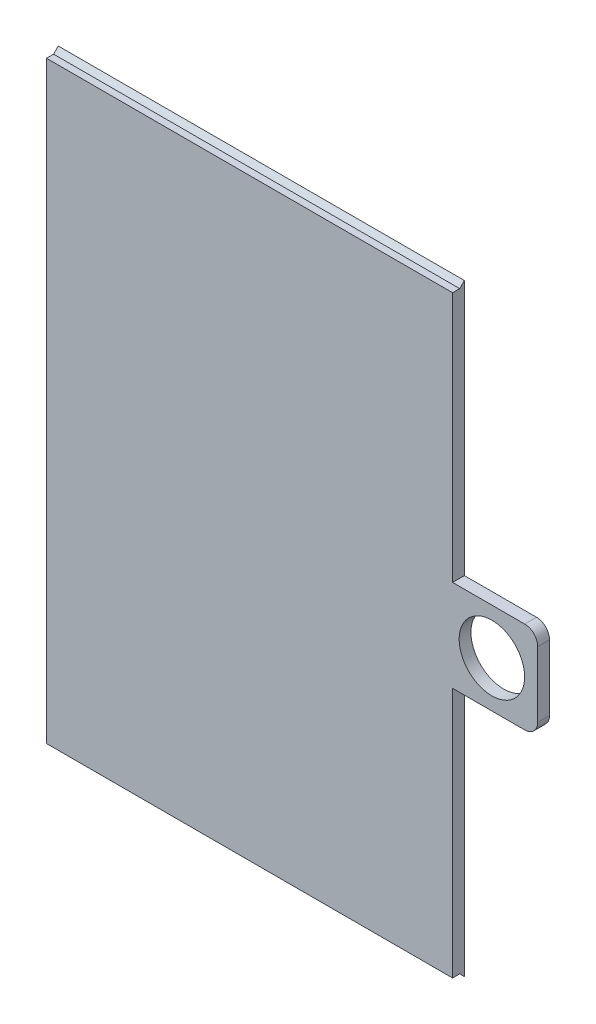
ISO-10303-21;
HEADER;
FILE_DESCRIPTION(('STEP AP214'),'2;1');
FILE_NAME('part.step','',(''),(''),'','','');
FILE_SCHEMA(('AUTOMOTIVE_DESIGN { 1 0 10303 214 1 1 1 1 }'));
ENDSEC;
DATA;
#1=APPLICATION_CONTEXT('core data for automotive mechanical design processes');
#2=APPLICATION_PROTOCOL_DEFINITION('international standard','automotive_design',2000,#1);
#3=PRODUCT_CONTEXT('',#1,'mechanical');
#4=PRODUCT('Part','Part','',(#3));
#5=PRODUCT_RELATED_PRODUCT_CATEGORY('part','',(#4));
#6=PRODUCT_DEFINITION_FORMATION('','',#4);
#7=PRODUCT_DEFINITION_CONTEXT('part definition',#1,'design');
#8=PRODUCT_DEFINITION('design','',#6,#7);
#9=PRODUCT_DEFINITION_SHAPE('','',#8);
#10=(LENGTH_UNIT() NAMED_UNIT(*) SI_UNIT(.MILLI.,.METRE.));
#11=(NAMED_UNIT(*) PLANE_ANGLE_UNIT() SI_UNIT($,.RADIAN.));
#12=(NAMED_UNIT(*) SI_UNIT($,.STERADIAN.) SOLID_ANGLE_UNIT());
#13=UNCERTAINTY_MEASURE_WITH_UNIT(LENGTH_MEASURE(1.E-05),#10,'distance_accuracy_value','');
#14=(GEOMETRIC_REPRESENTATION_CONTEXT(3) GLOBAL_UNCERTAINTY_ASSIGNED_CONTEXT((#13)) GLOBAL_UNIT_ASSIGNED_CONTEXT((#10,
#11,#12)) REPRESENTATION_CONTEXT('',''));
#15=CARTESIAN_POINT('',(0.,0.,0.));
#16=DIRECTION('',(0.,0.,1.));
#17=DIRECTION('',(1.,0.,0.));
#18=AXIS2_PLACEMENT_3D('',#15,#16,#17);
#19=CARTESIAN_POINT('',(45.,0.,0.));
#20=DIRECTION('',(1.,0.,0.));
#21=DIRECTION('',(0.,0.,-1.));
#22=AXIS2_PLACEMENT_3D('',#19,#20,#21);
#23=PLANE('',#22);
#24=DIRECTION('',(0.,1.,0.));
#25=VECTOR('',#24,1.);
#26=CARTESIAN_POINT('',(45.,0.,11.2));
#27=LINE('',#26,#25);
#28=CARTESIAN_POINT('',(45.,-5.,11.2));
#29=VERTEX_POINT('',#28);
#30=CARTESIAN_POINT('',(45.,4.99999999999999,11.2));
#31=VERTEX_POINT('',#30);
#32=EDGE_CURVE('E196',#29,#31,#27,.T.);
#33=ORIENTED_EDGE('',*,*,#32,.T.);
#34=DIRECTION('',(0.,0.,-1.));
#35=VECTOR('',#34,1.);
#36=CARTESIAN_POINT('',(45.,4.99999999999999,13.));
#37=LINE('',#36,#35);
#38=CARTESIAN_POINT('',(45.,5.,13.));
#39=VERTEX_POINT('',#38);
#40=EDGE_CURVE('E172',#39,#31,#37,.T.);
#41=ORIENTED_EDGE('',*,*,#40,.F.);
#42=DIRECTION('',(0.,-1.,0.));
#43=VECTOR('',#42,1.);
#44=CARTESIAN_POINT('',(45.,0.,13.));
#45=LINE('',#44,#43);
#46=CARTESIAN_POINT('',(45.,-4.99999999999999,13.));
#47=VERTEX_POINT('',#46);
#48=EDGE_CURVE('E193',#39,#47,#45,.T.);
#49=ORIENTED_EDGE('',*,*,#48,.T.);
#50=DIRECTION('',(0.,0.,-1.));
#51=VECTOR('',#50,1.);
#52=CARTESIAN_POINT('',(45.,-4.99999999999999,13.));
#53=LINE('',#52,#51);
#54=EDGE_CURVE('E174',#47,#29,#53,.T.);
#55=ORIENTED_EDGE('',*,*,#54,.T.);
#56=EDGE_LOOP('',(#33,#41,#49,#55));
#57=FACE_BOUND('',#56,.T.);
#58=ADVANCED_FACE('F40',(#57),#23,.T.);
#59=CARTESIAN_POINT('',(-122.051915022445,28.6085786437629,28.6085786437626));
#60=DIRECTION('',(0.,0.707106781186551,0.707106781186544));
#61=DIRECTION('',(0.,-0.707106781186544,0.707106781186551));
#62=AXIS2_PLACEMENT_3D('',#59,#60,#61);
#63=PLANE('',#62);
#64=DIRECTION('',(0.,-0.707106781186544,0.707106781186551));
#65=VECTOR('',#64,1.);
#66=CARTESIAN_POINT('',(32.,28.6085786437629,28.6085786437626));
#67=LINE('',#66,#65);
#68=CARTESIAN_POINT('',(32.,46.0171572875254,11.2));
#69=VERTEX_POINT('',#68);
#70=CARTESIAN_POINT('',(32.,45.3,11.9171572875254));
#71=VERTEX_POINT('',#70);
#72=EDGE_CURVE('E180',#69,#71,#67,.T.);
#73=ORIENTED_EDGE('',*,*,#72,.F.);
#74=DIRECTION('',(1.,0.,0.));
#75=VECTOR('',#74,1.);
#76=CARTESIAN_POINT('',(-122.051915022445,46.0171572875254,11.2));
#77=LINE('',#76,#75);
#78=CARTESIAN_POINT('',(-30.,46.0171572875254,11.2));
#79=VERTEX_POINT('',#78);
#80=EDGE_CURVE('E203',#79,#69,#77,.T.);
#81=ORIENTED_EDGE('',*,*,#80,.F.);
#82=DIRECTION('',(0.,0.707106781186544,-0.707106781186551));
#83=VECTOR('',#82,1.);
#84=CARTESIAN_POINT('',(-30.,28.6085786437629,28.6085786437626));
#85=LINE('',#84,#83);
#86=CARTESIAN_POINT('',(-30.,45.3,11.9171572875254));
#87=VERTEX_POINT('',#86);
#88=EDGE_CURVE('E209',#87,#79,#85,.T.);
#89=ORIENTED_EDGE('',*,*,#88,.F.);
#90=DIRECTION('',(1.,0.,0.));
#91=VECTOR('',#90,1.);
#92=CARTESIAN_POINT('',(-122.051915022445,45.3,11.9171572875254));
#93=LINE('',#92,#91);
#94=EDGE_CURVE('E199',#87,#71,#93,.T.);
#95=ORIENTED_EDGE('',*,*,#94,.T.);
#96=EDGE_LOOP('',(#73,#81,#89,#95));
#97=FACE_BOUND('',#96,.T.);
#98=ADVANCED_FACE('F42',(#97),#63,.T.);
#99=CARTESIAN_POINT('',(-122.051915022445,0.,11.2));
#100=DIRECTION('',(0.,0.,-1.));
#101=DIRECTION('',(-1.,0.,0.));
#102=AXIS2_PLACEMENT_3D('',#99,#100,#101);
#103=PLANE('',#102);
#104=CARTESIAN_POINT('',(38.,0.,11.2));
#105=DIRECTION('',(0.,0.,-1.));
#106=DIRECTION('',(-1.,0.,0.));
#107=AXIS2_PLACEMENT_3D('',#104,#105,#106);
#108=CIRCLE('',#107,5.);
#109=CARTESIAN_POINT('',(33.,0.,11.2));
#110=VERTEX_POINT('',#109);
#111=EDGE_CURVE('E158',#110,#110,#108,.T.);
#112=ORIENTED_EDGE('',*,*,#111,.F.);
#113=EDGE_LOOP('',(#112));
#114=FACE_BOUND('',#113,.T.);
#115=DIRECTION('',(0.,1.,0.));
#116=VECTOR('',#115,1.);
#117=CARTESIAN_POINT('',(32.,0.,11.2));
#118=LINE('',#117,#116);
#119=CARTESIAN_POINT('',(32.,7.,11.2));
#120=VERTEX_POINT('',#119);
#121=EDGE_CURVE('E182',#120,#69,#118,.T.);
#122=ORIENTED_EDGE('',*,*,#121,.F.);
#123=DIRECTION('',(-1.,0.,0.));
#124=VECTOR('',#123,1.);
#125=CARTESIAN_POINT('',(-122.051915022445,7.,11.2));
#126=LINE('',#125,#124);
#127=CARTESIAN_POINT('',(43.,7.,11.2));
#128=VERTEX_POINT('',#127);
#129=EDGE_CURVE('E191',#128,#120,#126,.T.);
#130=ORIENTED_EDGE('',*,*,#129,.F.);
#131=CARTESIAN_POINT('',(43.,5.,11.2));
#132=DIRECTION('',(0.,0.,-1.));
#133=DIRECTION('',(-1.,0.,0.));
#134=AXIS2_PLACEMENT_3D('',#131,#132,#133);
#135=CIRCLE('',#134,2.);
#136=EDGE_CURVE('E178',#31,#128,#135,.F.);
#137=ORIENTED_EDGE('',*,*,#136,.F.);
#138=ORIENTED_EDGE('',*,*,#32,.F.);
#139=CARTESIAN_POINT('',(43.,-5.,11.2));
#140=DIRECTION('',(0.,0.,-1.));
#141=DIRECTION('',(-1.,0.,0.));
#142=AXIS2_PLACEMENT_3D('',#139,#140,#141);
#143=CIRCLE('',#142,2.);
#144=CARTESIAN_POINT('',(43.,-7.,11.2));
#145=VERTEX_POINT('',#144);
#146=EDGE_CURVE('E56',#145,#29,#143,.F.);
#147=ORIENTED_EDGE('',*,*,#146,.F.);
#148=DIRECTION('',(1.,0.,0.));
#149=VECTOR('',#148,1.);
#150=CARTESIAN_POINT('',(-122.051915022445,-7.,11.2));
#151=LINE('',#150,#149);
#152=CARTESIAN_POINT('',(32.,-7.,11.2));
#153=VERTEX_POINT('',#152);
#154=EDGE_CURVE('E189',#153,#145,#151,.T.);
#155=ORIENTED_EDGE('',*,*,#154,.F.);
#156=DIRECTION('',(0.,1.,0.));
#157=VECTOR('',#156,1.);
#158=CARTESIAN_POINT('',(32.,0.,11.2));
#159=LINE('',#158,#157);
#160=CARTESIAN_POINT('',(32.,-46.0171572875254,11.2));
#161=VERTEX_POINT('',#160);
#162=EDGE_CURVE('E136',#161,#153,#159,.T.);
#163=ORIENTED_EDGE('',*,*,#162,.F.);
#164=DIRECTION('',(1.,0.,0.));
#165=VECTOR('',#164,1.);
#166=CARTESIAN_POINT('',(-122.051915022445,-46.0171572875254,11.2));
#167=LINE('',#166,#165);
#168=CARTESIAN_POINT('',(-30.,-46.0171572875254,11.2));
#169=VERTEX_POINT('',#168);
#170=EDGE_CURVE('E213',#169,#161,#167,.T.);
#171=ORIENTED_EDGE('',*,*,#170,.F.);
#172=DIRECTION('',(0.,-1.,0.));
#173=VECTOR('',#172,1.);
#174=CARTESIAN_POINT('',(-30.,0.,11.2));
#175=LINE('',#174,#173);
#176=EDGE_CURVE('E207',#79,#169,#175,.T.);
#177=ORIENTED_EDGE('',*,*,#176,.F.);
#178=ORIENTED_EDGE('',*,*,#80,.T.);
#179=EDGE_LOOP('',(#122,#130,#137,#138,#147,#155,#163,#171,#177,#178));
#180=FACE_BOUND('',#179,.T.);
#181=ADVANCED_FACE('F248',(#114,#180),#103,.T.);
#182=CARTESIAN_POINT('',(-122.051915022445,-28.608578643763,28.6085786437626));
#183=DIRECTION('',(0.,-0.707106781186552,0.707106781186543));
#184=DIRECTION('',(0.,-0.707106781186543,-0.707106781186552));
#185=AXIS2_PLACEMENT_3D('',#182,#183,#184);
#186=PLANE('',#185);
#187=DIRECTION('',(0.,-0.707106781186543,-0.707106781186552));
#188=VECTOR('',#187,1.);
#189=CARTESIAN_POINT('',(32.,-28.608578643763,28.6085786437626));
#190=LINE('',#189,#188);
#191=CARTESIAN_POINT('',(32.,-45.3,11.9171572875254));
#192=VERTEX_POINT('',#191);
#193=EDGE_CURVE('E186',#192,#161,#190,.T.);
#194=ORIENTED_EDGE('',*,*,#193,.F.);
#195=DIRECTION('',(1.,0.,0.));
#196=VECTOR('',#195,1.);
#197=CARTESIAN_POINT('',(-122.051915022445,-45.3,11.9171572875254));
#198=LINE('',#197,#196);
#199=CARTESIAN_POINT('',(-30.,-45.3,11.9171572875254));
#200=VERTEX_POINT('',#199);
#201=EDGE_CURVE('E216',#200,#192,#198,.T.);
#202=ORIENTED_EDGE('',*,*,#201,.F.);
#203=DIRECTION('',(0.,0.707106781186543,0.707106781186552));
#204=VECTOR('',#203,1.);
#205=CARTESIAN_POINT('',(-30.,-28.608578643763,28.6085786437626));
#206=LINE('',#205,#204);
#207=EDGE_CURVE('E205',#169,#200,#206,.T.);
#208=ORIENTED_EDGE('',*,*,#207,.F.);
#209=ORIENTED_EDGE('',*,*,#170,.T.);
#210=EDGE_LOOP('',(#194,#202,#208,#209));
#211=FACE_BOUND('',#210,.T.);
#212=ADVANCED_FACE('F256',(#211),#186,.T.);
#213=CARTESIAN_POINT('',(-122.051915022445,-45.3000000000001,2.90283981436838E-13));
#214=DIRECTION('',(0.,-1.,0.));
#215=DIRECTION('',(0.,0.,-1.));
#216=AXIS2_PLACEMENT_3D('',#213,#214,#215);
#217=PLANE('',#216);
#218=DIRECTION('',(0.,0.,-1.));
#219=VECTOR('',#218,1.);
#220=CARTESIAN_POINT('',(32.,-45.3000000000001,2.90283981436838E-13));
#221=LINE('',#220,#219);
#222=CARTESIAN_POINT('',(32.,-45.3,13.));
#223=VERTEX_POINT('',#222);
#224=EDGE_CURVE('E184',#223,#192,#221,.T.);
#225=ORIENTED_EDGE('',*,*,#224,.F.);
#226=DIRECTION('',(1.,0.,0.));
#227=VECTOR('',#226,1.);
#228=CARTESIAN_POINT('',(-122.051915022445,-45.3,13.));
#229=LINE('',#228,#227);
#230=CARTESIAN_POINT('',(-30.,-45.3,13.));
#231=VERTEX_POINT('',#230);
#232=EDGE_CURVE('E155',#231,#223,#229,.T.);
#233=ORIENTED_EDGE('',*,*,#232,.F.);
#234=DIRECTION('',(0.,0.,1.));
#235=VECTOR('',#234,1.);
#236=CARTESIAN_POINT('',(-30.,-45.3000000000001,2.90283981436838E-13));
#237=LINE('',#236,#235);
#238=EDGE_CURVE('E202',#200,#231,#237,.T.);
#239=ORIENTED_EDGE('',*,*,#238,.F.);
#240=ORIENTED_EDGE('',*,*,#201,.T.);
#241=EDGE_LOOP('',(#225,#233,#239,#240));
#242=FACE_BOUND('',#241,.T.);
#243=ADVANCED_FACE('F258',(#242),#217,.T.);
#244=CARTESIAN_POINT('',(-122.051915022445,0.,13.));
#245=DIRECTION('',(0.,0.,1.));
#246=DIRECTION('',(0.,-1.,0.));
#247=AXIS2_PLACEMENT_3D('',#244,#245,#246);
#248=PLANE('',#247);
#249=CARTESIAN_POINT('',(38.,0.,13.));
#250=DIRECTION('',(0.,0.,1.));
#251=DIRECTION('',(0.,-1.,0.));
#252=AXIS2_PLACEMENT_3D('',#249,#250,#251);
#253=CIRCLE('',#252,5.);
#254=CARTESIAN_POINT('',(38.,-5.,13.));
#255=VERTEX_POINT('',#254);
#256=EDGE_CURVE('E44',#255,#255,#253,.T.);
#257=ORIENTED_EDGE('',*,*,#256,.F.);
#258=EDGE_LOOP('',(#257));
#259=FACE_BOUND('',#258,.T.);
#260=DIRECTION('',(0.,1.,0.));
#261=VECTOR('',#260,1.);
#262=CARTESIAN_POINT('',(32.,46.0171572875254,13.));
#263=LINE('',#262,#261);
#264=CARTESIAN_POINT('',(32.,7.,13.));
#265=VERTEX_POINT('',#264);
#266=CARTESIAN_POINT('',(32.,45.3,13.));
#267=VERTEX_POINT('',#266);
#268=EDGE_CURVE('E156',#265,#267,#263,.T.);
#269=ORIENTED_EDGE('',*,*,#268,.T.);
#270=DIRECTION('',(1.,0.,0.));
#271=VECTOR('',#270,1.);
#272=CARTESIAN_POINT('',(-122.051915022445,45.3,13.));
#273=LINE('',#272,#271);
#274=CARTESIAN_POINT('',(-30.,45.3,13.));
#275=VERTEX_POINT('',#274);
#276=EDGE_CURVE('E220',#275,#267,#273,.T.);
#277=ORIENTED_EDGE('',*,*,#276,.F.);
#278=DIRECTION('',(0.,1.,0.));
#279=VECTOR('',#278,1.);
#280=CARTESIAN_POINT('',(-30.,0.,13.));
#281=LINE('',#280,#279);
#282=EDGE_CURVE('E200',#231,#275,#281,.T.);
#283=ORIENTED_EDGE('',*,*,#282,.F.);
#284=ORIENTED_EDGE('',*,*,#232,.T.);
#285=DIRECTION('',(0.,1.,0.));
#286=VECTOR('',#285,1.);
#287=CARTESIAN_POINT('',(32.,-7.,13.));
#288=LINE('',#287,#286);
#289=CARTESIAN_POINT('',(32.,-7.,13.));
#290=VERTEX_POINT('',#289);
#291=EDGE_CURVE('E133',#223,#290,#288,.T.);
#292=ORIENTED_EDGE('',*,*,#291,.T.);
#293=DIRECTION('',(1.,0.,0.));
#294=VECTOR('',#293,1.);
#295=CARTESIAN_POINT('',(43.,-7.,13.));
#296=LINE('',#295,#294);
#297=CARTESIAN_POINT('',(43.,-7.,13.));
#298=VERTEX_POINT('',#297);
#299=EDGE_CURVE('E143',#290,#298,#296,.T.);
#300=ORIENTED_EDGE('',*,*,#299,.T.);
#301=CARTESIAN_POINT('',(43.,-5.,13.));
#302=DIRECTION('',(0.,0.,1.));
#303=DIRECTION('',(-1.,0.,0.));
#304=AXIS2_PLACEMENT_3D('',#301,#302,#303);
#305=CIRCLE('',#304,2.);
#306=EDGE_CURVE('E148',#298,#47,#305,.T.);
#307=ORIENTED_EDGE('',*,*,#306,.T.);
#308=ORIENTED_EDGE('',*,*,#48,.F.);
#309=CARTESIAN_POINT('',(43.,5.,13.));
#310=DIRECTION('',(0.,0.,1.));
#311=DIRECTION('',(1.,0.,0.));
#312=AXIS2_PLACEMENT_3D('',#309,#310,#311);
#313=CIRCLE('',#312,2.);
#314=CARTESIAN_POINT('',(43.,7.,13.));
#315=VERTEX_POINT('',#314);
#316=EDGE_CURVE('E64',#39,#315,#313,.T.);
#317=ORIENTED_EDGE('',*,*,#316,.T.);
#318=DIRECTION('',(-1.,0.,0.));
#319=VECTOR('',#318,1.);
#320=CARTESIAN_POINT('',(32.,7.,13.));
#321=LINE('',#320,#319);
#322=EDGE_CURVE('E140',#315,#265,#321,.T.);
#323=ORIENTED_EDGE('',*,*,#322,.T.);
#324=EDGE_LOOP('',(#269,#277,#283,#284,#292,#300,#307,#308,#317,#323));
#325=FACE_BOUND('',#324,.T.);
#326=ADVANCED_FACE('F152',(#259,#325),#248,.T.);
#327=CARTESIAN_POINT('',(-122.051915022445,45.2999999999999,-2.90283981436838E-13));
#328=DIRECTION('',(0.,1.,0.));
#329=DIRECTION('',(0.,0.,1.));
#330=AXIS2_PLACEMENT_3D('',#327,#328,#329);
#331=PLANE('',#330);
#332=DIRECTION('',(0.,0.,1.));
#333=VECTOR('',#332,1.);
#334=CARTESIAN_POINT('',(32.,45.2999999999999,-2.90283981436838E-13));
#335=LINE('',#334,#333);
#336=EDGE_CURVE('E11',#71,#267,#335,.T.);
#337=ORIENTED_EDGE('',*,*,#336,.F.);
#338=ORIENTED_EDGE('',*,*,#94,.F.);
#339=DIRECTION('',(0.,0.,-1.));
#340=VECTOR('',#339,1.);
#341=CARTESIAN_POINT('',(-30.,45.2999999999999,-2.90283981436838E-13));
#342=LINE('',#341,#340);
#343=EDGE_CURVE('E49',#275,#87,#342,.T.);
#344=ORIENTED_EDGE('',*,*,#343,.F.);
#345=ORIENTED_EDGE('',*,*,#276,.T.);
#346=EDGE_LOOP('',(#337,#338,#344,#345));
#347=FACE_BOUND('',#346,.T.);
#348=ADVANCED_FACE('F237',(#347),#331,.T.);
#349=CARTESIAN_POINT('',(-30.,-45.5,13.));
#350=DIRECTION('',(1.,0.,0.));
#351=DIRECTION('',(0.,0.,-1.));
#352=AXIS2_PLACEMENT_3D('',#349,#350,#351);
#353=PLANE('',#352);
#354=ORIENTED_EDGE('',*,*,#88,.T.);
#355=ORIENTED_EDGE('',*,*,#176,.T.);
#356=ORIENTED_EDGE('',*,*,#207,.T.);
#357=ORIENTED_EDGE('',*,*,#238,.T.);
#358=ORIENTED_EDGE('',*,*,#282,.T.);
#359=ORIENTED_EDGE('',*,*,#343,.T.);
#360=EDGE_LOOP('',(#354,#355,#356,#357,#358,#359));
#361=FACE_BOUND('',#360,.T.);
#362=ADVANCED_FACE('F228',(#361),#353,.F.);
#363=CARTESIAN_POINT('',(43.,-5.,13.));
#364=DIRECTION('',(0.,0.,-1.));
#365=DIRECTION('',(-1.,0.,0.));
#366=AXIS2_PLACEMENT_3D('',#363,#364,#365);
#367=CYLINDRICAL_SURFACE('',#366,2.);
#368=ORIENTED_EDGE('',*,*,#146,.T.);
#369=ORIENTED_EDGE('',*,*,#54,.F.);
#370=ORIENTED_EDGE('',*,*,#306,.F.);
#371=DIRECTION('',(0.,0.,-1.));
#372=VECTOR('',#371,1.);
#373=CARTESIAN_POINT('',(43.,-7.,13.));
#374=LINE('',#373,#372);
#375=EDGE_CURVE('E139',#298,#145,#374,.T.);
#376=ORIENTED_EDGE('',*,*,#375,.T.);
#377=EDGE_LOOP('',(#368,#369,#370,#376));
#378=FACE_BOUND('',#377,.T.);
#379=ADVANCED_FACE('F260',(#378),#367,.T.);
#380=CARTESIAN_POINT('',(32.,-7.,13.));
#381=DIRECTION('',(-1.,0.,0.));
#382=DIRECTION('',(0.,0.,1.));
#383=AXIS2_PLACEMENT_3D('',#380,#381,#382);
#384=PLANE('',#383);
#385=ORIENTED_EDGE('',*,*,#162,.T.);
#386=DIRECTION('',(0.,0.,-1.));
#387=VECTOR('',#386,1.);
#388=CARTESIAN_POINT('',(32.,-7.,13.));
#389=LINE('',#388,#387);
#390=EDGE_CURVE('E129',#290,#153,#389,.T.);
#391=ORIENTED_EDGE('',*,*,#390,.F.);
#392=ORIENTED_EDGE('',*,*,#291,.F.);
#393=ORIENTED_EDGE('',*,*,#224,.T.);
#394=ORIENTED_EDGE('',*,*,#193,.T.);
#395=EDGE_LOOP('',(#385,#391,#392,#393,#394));
#396=FACE_BOUND('',#395,.T.);
#397=ADVANCED_FACE('F131',(#396),#384,.F.);
#398=CARTESIAN_POINT('',(43.,-7.,13.));
#399=DIRECTION('',(0.,1.,0.));
#400=DIRECTION('',(0.,0.,1.));
#401=AXIS2_PLACEMENT_3D('',#398,#399,#400);
#402=PLANE('',#401);
#403=ORIENTED_EDGE('',*,*,#154,.T.);
#404=ORIENTED_EDGE('',*,*,#375,.F.);
#405=ORIENTED_EDGE('',*,*,#299,.F.);
#406=ORIENTED_EDGE('',*,*,#390,.T.);
#407=EDGE_LOOP('',(#403,#404,#405,#406));
#408=FACE_BOUND('',#407,.T.);
#409=ADVANCED_FACE('F144',(#408),#402,.F.);
#410=CARTESIAN_POINT('',(32.,46.0171572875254,13.));
#411=DIRECTION('',(-1.,0.,0.));
#412=DIRECTION('',(0.,0.,1.));
#413=AXIS2_PLACEMENT_3D('',#410,#411,#412);
#414=PLANE('',#413);
#415=ORIENTED_EDGE('',*,*,#121,.T.);
#416=ORIENTED_EDGE('',*,*,#72,.T.);
#417=ORIENTED_EDGE('',*,*,#336,.T.);
#418=ORIENTED_EDGE('',*,*,#268,.F.);
#419=DIRECTION('',(0.,0.,-1.));
#420=VECTOR('',#419,1.);
#421=CARTESIAN_POINT('',(32.,7.,13.));
#422=LINE('',#421,#420);
#423=EDGE_CURVE('E166',#265,#120,#422,.T.);
#424=ORIENTED_EDGE('',*,*,#423,.T.);
#425=EDGE_LOOP('',(#415,#416,#417,#418,#424));
#426=FACE_BOUND('',#425,.T.);
#427=ADVANCED_FACE('F240',(#426),#414,.F.);
#428=CARTESIAN_POINT('',(32.,7.,13.));
#429=DIRECTION('',(0.,-1.,0.));
#430=DIRECTION('',(0.,0.,-1.));
#431=AXIS2_PLACEMENT_3D('',#428,#429,#430);
#432=PLANE('',#431);
#433=ORIENTED_EDGE('',*,*,#129,.T.);
#434=ORIENTED_EDGE('',*,*,#423,.F.);
#435=ORIENTED_EDGE('',*,*,#322,.F.);
#436=DIRECTION('',(0.,0.,-1.));
#437=VECTOR('',#436,1.);
#438=CARTESIAN_POINT('',(43.,7.,13.));
#439=LINE('',#438,#437);
#440=EDGE_CURVE('E169',#315,#128,#439,.T.);
#441=ORIENTED_EDGE('',*,*,#440,.T.);
#442=EDGE_LOOP('',(#433,#434,#435,#441));
#443=FACE_BOUND('',#442,.T.);
#444=ADVANCED_FACE('F244',(#443),#432,.F.);
#445=CARTESIAN_POINT('',(43.,5.,13.));
#446=DIRECTION('',(0.,0.,-1.));
#447=DIRECTION('',(-1.,0.,0.));
#448=AXIS2_PLACEMENT_3D('',#445,#446,#447);
#449=CYLINDRICAL_SURFACE('',#448,2.);
#450=ORIENTED_EDGE('',*,*,#136,.T.);
#451=ORIENTED_EDGE('',*,*,#440,.F.);
#452=ORIENTED_EDGE('',*,*,#316,.F.);
#453=ORIENTED_EDGE('',*,*,#40,.T.);
#454=EDGE_LOOP('',(#450,#451,#452,#453));
#455=FACE_BOUND('',#454,.T.);
#456=ADVANCED_FACE('F262',(#455),#449,.T.);
#457=CARTESIAN_POINT('',(38.,0.,-1.));
#458=DIRECTION('',(0.,0.,1.));
#459=DIRECTION('',(1.,0.,0.));
#460=AXIS2_PLACEMENT_3D('',#457,#458,#459);
#461=CYLINDRICAL_SURFACE('',#460,5.);
#462=ORIENTED_EDGE('',*,*,#111,.T.);
#463=EDGE_LOOP('',(#462));
#464=FACE_BOUND('',#463,.T.);
#465=ORIENTED_EDGE('',*,*,#256,.T.);
#466=EDGE_LOOP('',(#465));
#467=FACE_BOUND('',#466,.T.);
#468=ADVANCED_FACE('F264',(#464,#467),#461,.F.);
#469=CLOSED_SHELL('',(#58,#98,#181,#212,#243,#326,#348,#362,#379,#397,#409,#427,#444,#456,#468));
#470=MANIFOLD_SOLID_BREP('B2',#469);
#471=ADVANCED_BREP_SHAPE_REPRESENTATION('',(#18,#470),#14);
#472=SHAPE_DEFINITION_REPRESENTATION(#9,#471);
ENDSEC;
END-ISO-10303-21;
